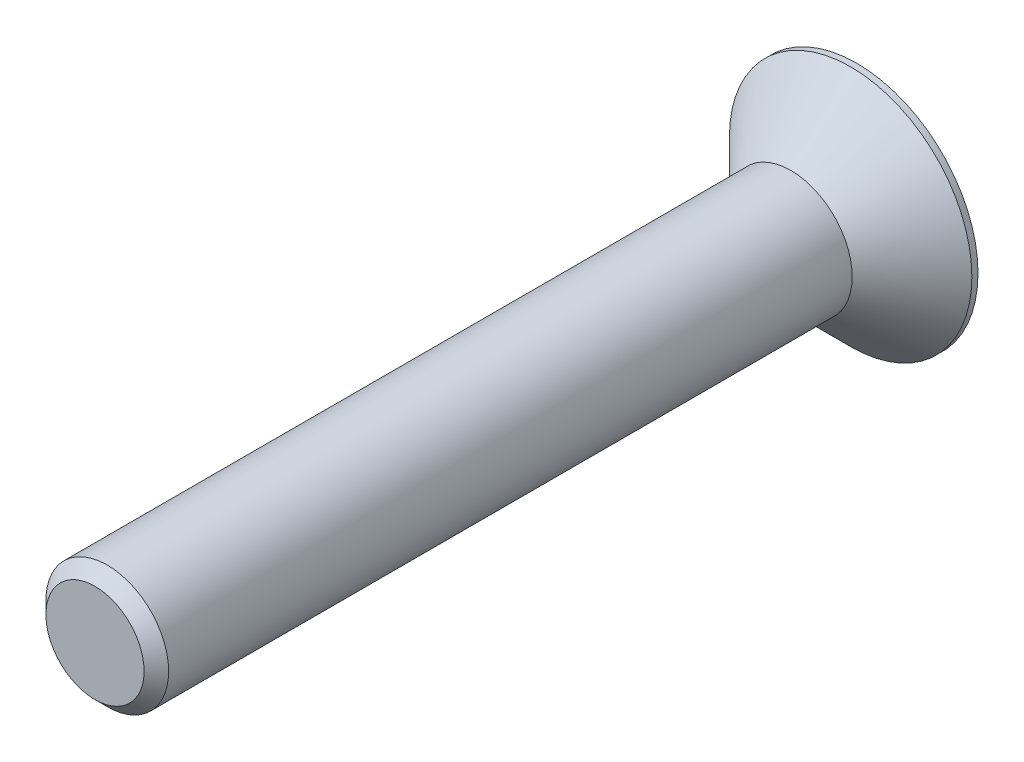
ISO-10303-21;
HEADER;
FILE_DESCRIPTION(('STEP AP214'),'2;1');
FILE_NAME('part.step','',(''),(''),'','','');
FILE_SCHEMA(('AUTOMOTIVE_DESIGN { 1 0 10303 214 1 1 1 1 }'));
ENDSEC;
DATA;
#1=APPLICATION_CONTEXT('core data for automotive mechanical design processes');
#2=APPLICATION_PROTOCOL_DEFINITION('international standard','automotive_design',2000,#1);
#3=PRODUCT_CONTEXT('',#1,'mechanical');
#4=PRODUCT('Part','Part','',(#3));
#5=PRODUCT_RELATED_PRODUCT_CATEGORY('part','',(#4));
#6=PRODUCT_DEFINITION_FORMATION('','',#4);
#7=PRODUCT_DEFINITION_CONTEXT('part definition',#1,'design');
#8=PRODUCT_DEFINITION('design','',#6,#7);
#9=PRODUCT_DEFINITION_SHAPE('','',#8);
#10=(LENGTH_UNIT() NAMED_UNIT(*) SI_UNIT(.MILLI.,.METRE.));
#11=(NAMED_UNIT(*) PLANE_ANGLE_UNIT() SI_UNIT($,.RADIAN.));
#12=(NAMED_UNIT(*) SI_UNIT($,.STERADIAN.) SOLID_ANGLE_UNIT());
#13=UNCERTAINTY_MEASURE_WITH_UNIT(LENGTH_MEASURE(1.E-05),#10,'distance_accuracy_value','');
#14=(GEOMETRIC_REPRESENTATION_CONTEXT(3) GLOBAL_UNCERTAINTY_ASSIGNED_CONTEXT((#13)) GLOBAL_UNIT_ASSIGNED_CONTEXT((#10,
#11,#12)) REPRESENTATION_CONTEXT('',''));
#15=CARTESIAN_POINT('',(0.,0.,0.));
#16=DIRECTION('',(0.,0.,1.));
#17=DIRECTION('',(1.,0.,0.));
#18=AXIS2_PLACEMENT_3D('',#15,#16,#17);
#19=CARTESIAN_POINT('',(7.9,0.,-4.29999999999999));
#20=DIRECTION('',(0.,0.,1.));
#21=DIRECTION('',(1.,0.,0.));
#22=AXIS2_PLACEMENT_3D('',#19,#20,#21);
#23=PLANE('',#22);
#24=CARTESIAN_POINT('',(0.,0.,-4.29999999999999));
#25=DIRECTION('',(0.,0.,-1.));
#26=DIRECTION('',(-1.,0.,0.));
#27=AXIS2_PLACEMENT_3D('',#24,#25,#26);
#28=CIRCLE('',#27,7.9);
#29=CARTESIAN_POINT('',(-7.9,0.,-4.29999999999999));
#30=VERTEX_POINT('',#29);
#31=EDGE_CURVE('E140',#30,#30,#28,.T.);
#32=ORIENTED_EDGE('',*,*,#31,.T.);
#33=EDGE_LOOP('',(#32));
#34=FACE_BOUND('',#33,.T.);
#35=DIRECTION('',(-0.86602540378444,0.499999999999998,0.));
#36=VECTOR('',#35,1.);
#37=CARTESIAN_POINT('',(0.,2.88675134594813,-4.29999999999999));
#38=LINE('',#37,#36);
#39=CARTESIAN_POINT('',(2.5,1.44337567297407,-4.29999999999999));
#40=VERTEX_POINT('',#39);
#41=CARTESIAN_POINT('',(0.,2.88675134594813,-4.29999999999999));
#42=VERTEX_POINT('',#41);
#43=EDGE_CURVE('E45',#40,#42,#38,.T.);
#44=ORIENTED_EDGE('',*,*,#43,.T.);
#45=DIRECTION('',(-0.866025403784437,-0.500000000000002,0.));
#46=VECTOR('',#45,1.);
#47=CARTESIAN_POINT('',(-2.5,1.44337567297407,-4.29999999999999));
#48=LINE('',#47,#46);
#49=CARTESIAN_POINT('',(-2.5,1.44337567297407,-4.29999999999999));
#50=VERTEX_POINT('',#49);
#51=EDGE_CURVE('E116',#42,#50,#48,.T.);
#52=ORIENTED_EDGE('',*,*,#51,.T.);
#53=DIRECTION('',(0.,-1.,0.));
#54=VECTOR('',#53,1.);
#55=CARTESIAN_POINT('',(-2.5,-1.44337567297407,-4.29999999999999));
#56=LINE('',#55,#54);
#57=CARTESIAN_POINT('',(-2.5,-1.44337567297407,-4.29999999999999));
#58=VERTEX_POINT('',#57);
#59=EDGE_CURVE('E120',#50,#58,#56,.T.);
#60=ORIENTED_EDGE('',*,*,#59,.T.);
#61=DIRECTION('',(0.866025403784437,-0.500000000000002,0.));
#62=VECTOR('',#61,1.);
#63=CARTESIAN_POINT('',(-2.5,-1.44337567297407,-4.29999999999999));
#64=LINE('',#63,#62);
#65=CARTESIAN_POINT('',(0.,-2.88675134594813,-4.29999999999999));
#66=VERTEX_POINT('',#65);
#67=EDGE_CURVE('E123',#58,#66,#64,.T.);
#68=ORIENTED_EDGE('',*,*,#67,.T.);
#69=DIRECTION('',(0.86602540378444,0.499999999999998,0.));
#70=VECTOR('',#69,1.);
#71=CARTESIAN_POINT('',(0.,-2.88675134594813,-4.29999999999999));
#72=LINE('',#71,#70);
#73=CARTESIAN_POINT('',(2.5,-1.44337567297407,-4.29999999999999));
#74=VERTEX_POINT('',#73);
#75=EDGE_CURVE('E106',#66,#74,#72,.T.);
#76=ORIENTED_EDGE('',*,*,#75,.T.);
#77=DIRECTION('',(0.,1.,0.));
#78=VECTOR('',#77,1.);
#79=CARTESIAN_POINT('',(2.5,-1.44337567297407,-4.29999999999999));
#80=LINE('',#79,#78);
#81=EDGE_CURVE('E126',#74,#40,#80,.T.);
#82=ORIENTED_EDGE('',*,*,#81,.T.);
#83=EDGE_LOOP('',(#44,#52,#60,#68,#76,#82));
#84=FACE_BOUND('',#83,.T.);
#85=ADVANCED_FACE('F30',(#34,#84),#23,.F.);
#86=CARTESIAN_POINT('',(0.,0.,0.));
#87=DIRECTION('',(0.,0.,-1.));
#88=DIRECTION('',(-1.,0.,0.));
#89=AXIS2_PLACEMENT_3D('',#86,#87,#88);
#90=CYLINDRICAL_SURFACE('',#89,7.9);
#91=ORIENTED_EDGE('',*,*,#31,.F.);
#92=EDGE_LOOP('',(#91));
#93=FACE_BOUND('',#92,.T.);
#94=CARTESIAN_POINT('',(0.,0.,-3.89999999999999));
#95=DIRECTION('',(0.,0.,-1.));
#96=DIRECTION('',(-1.,0.,0.));
#97=AXIS2_PLACEMENT_3D('',#94,#95,#96);
#98=CIRCLE('',#97,7.9);
#99=CARTESIAN_POINT('',(-7.9,0.,-3.89999999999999));
#100=VERTEX_POINT('',#99);
#101=EDGE_CURVE('E137',#100,#100,#98,.T.);
#102=ORIENTED_EDGE('',*,*,#101,.T.);
#103=EDGE_LOOP('',(#102));
#104=FACE_BOUND('',#103,.T.);
#105=ADVANCED_FACE('F157',(#93,#104),#90,.T.);
#106=CARTESIAN_POINT('',(0.,0.,0.));
#107=DIRECTION('',(0.,0.,-1.));
#108=DIRECTION('',(-1.,0.,0.));
#109=AXIS2_PLACEMENT_3D('',#106,#107,#108);
#110=CONICAL_SURFACE('',#109,4.,0.78539816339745);
#111=ORIENTED_EDGE('',*,*,#101,.F.);
#112=EDGE_LOOP('',(#111));
#113=FACE_BOUND('',#112,.T.);
#114=CARTESIAN_POINT('',(0.,0.,0.));
#115=DIRECTION('',(0.,0.,1.));
#116=DIRECTION('',(1.,0.,0.));
#117=AXIS2_PLACEMENT_3D('',#114,#115,#116);
#118=CIRCLE('',#117,4.);
#119=CARTESIAN_POINT('',(4.,0.,0.));
#120=VERTEX_POINT('',#119);
#121=EDGE_CURVE('E117',#120,#120,#118,.T.);
#122=ORIENTED_EDGE('',*,*,#121,.F.);
#123=EDGE_LOOP('',(#122));
#124=FACE_BOUND('',#123,.T.);
#125=ADVANCED_FACE('F162',(#113,#124),#110,.T.);
#126=CARTESIAN_POINT('',(0.,2.88675134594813,-0.499999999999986));
#127=DIRECTION('',(-0.499999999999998,-0.86602540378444,0.));
#128=DIRECTION('',(0.86602540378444,-0.499999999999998,0.));
#129=AXIS2_PLACEMENT_3D('',#126,#127,#128);
#130=PLANE('',#129);
#131=ORIENTED_EDGE('',*,*,#43,.F.);
#132=DIRECTION('',(0.,0.,-1.));
#133=VECTOR('',#132,1.);
#134=CARTESIAN_POINT('',(2.5,1.44337567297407,-0.499999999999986));
#135=LINE('',#134,#133);
#136=CARTESIAN_POINT('',(2.5,1.44337567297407,-0.499999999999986));
#137=VERTEX_POINT('',#136);
#138=EDGE_CURVE('E111',#137,#40,#135,.T.);
#139=ORIENTED_EDGE('',*,*,#138,.F.);
#140=DIRECTION('',(-0.86602540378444,0.499999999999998,0.));
#141=VECTOR('',#140,1.);
#142=CARTESIAN_POINT('',(0.,2.88675134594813,-0.499999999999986));
#143=LINE('',#142,#141);
#144=CARTESIAN_POINT('',(0.,2.88675134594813,-0.499999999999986));
#145=VERTEX_POINT('',#144);
#146=EDGE_CURVE('E129',#137,#145,#143,.T.);
#147=ORIENTED_EDGE('',*,*,#146,.T.);
#148=DIRECTION('',(0.,0.,-1.));
#149=VECTOR('',#148,1.);
#150=CARTESIAN_POINT('',(0.,2.88675134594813,-0.499999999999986));
#151=LINE('',#150,#149);
#152=EDGE_CURVE('E135',#145,#42,#151,.T.);
#153=ORIENTED_EDGE('',*,*,#152,.T.);
#154=EDGE_LOOP('',(#131,#139,#147,#153));
#155=FACE_BOUND('',#154,.T.);
#156=ADVANCED_FACE('F169',(#155),#130,.T.);
#157=CARTESIAN_POINT('',(-2.5,1.44337567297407,-0.499999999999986));
#158=DIRECTION('',(0.500000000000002,-0.866025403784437,0.));
#159=DIRECTION('',(0.866025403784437,0.500000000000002,0.));
#160=AXIS2_PLACEMENT_3D('',#157,#158,#159);
#161=PLANE('',#160);
#162=ORIENTED_EDGE('',*,*,#51,.F.);
#163=ORIENTED_EDGE('',*,*,#152,.F.);
#164=DIRECTION('',(-0.866025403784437,-0.500000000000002,0.));
#165=VECTOR('',#164,1.);
#166=CARTESIAN_POINT('',(-2.5,1.44337567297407,-0.499999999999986));
#167=LINE('',#166,#165);
#168=CARTESIAN_POINT('',(-2.5,1.44337567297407,-0.499999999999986));
#169=VERTEX_POINT('',#168);
#170=EDGE_CURVE('E84',#145,#169,#167,.T.);
#171=ORIENTED_EDGE('',*,*,#170,.T.);
#172=DIRECTION('',(0.,0.,-1.));
#173=VECTOR('',#172,1.);
#174=CARTESIAN_POINT('',(-2.5,1.44337567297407,-0.499999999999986));
#175=LINE('',#174,#173);
#176=EDGE_CURVE('E133',#169,#50,#175,.T.);
#177=ORIENTED_EDGE('',*,*,#176,.T.);
#178=EDGE_LOOP('',(#162,#163,#171,#177));
#179=FACE_BOUND('',#178,.T.);
#180=ADVANCED_FACE('F173',(#179),#161,.T.);
#181=CARTESIAN_POINT('',(-2.5,-1.44337567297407,-0.499999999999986));
#182=DIRECTION('',(1.,0.,0.));
#183=DIRECTION('',(0.,0.,-1.));
#184=AXIS2_PLACEMENT_3D('',#181,#182,#183);
#185=PLANE('',#184);
#186=ORIENTED_EDGE('',*,*,#59,.F.);
#187=ORIENTED_EDGE('',*,*,#176,.F.);
#188=DIRECTION('',(0.,-1.,0.));
#189=VECTOR('',#188,1.);
#190=CARTESIAN_POINT('',(-2.5,-1.44337567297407,-0.499999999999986));
#191=LINE('',#190,#189);
#192=CARTESIAN_POINT('',(-2.5,-1.44337567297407,-0.499999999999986));
#193=VERTEX_POINT('',#192);
#194=EDGE_CURVE('E102',#169,#193,#191,.T.);
#195=ORIENTED_EDGE('',*,*,#194,.T.);
#196=DIRECTION('',(0.,0.,-1.));
#197=VECTOR('',#196,1.);
#198=CARTESIAN_POINT('',(-2.5,-1.44337567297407,-0.499999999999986));
#199=LINE('',#198,#197);
#200=EDGE_CURVE('E99',#193,#58,#199,.T.);
#201=ORIENTED_EDGE('',*,*,#200,.T.);
#202=EDGE_LOOP('',(#186,#187,#195,#201));
#203=FACE_BOUND('',#202,.T.);
#204=ADVANCED_FACE('F176',(#203),#185,.T.);
#205=CARTESIAN_POINT('',(-2.5,-1.44337567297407,-0.499999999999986));
#206=DIRECTION('',(0.500000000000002,0.866025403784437,0.));
#207=DIRECTION('',(-0.866025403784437,0.500000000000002,0.));
#208=AXIS2_PLACEMENT_3D('',#205,#206,#207);
#209=PLANE('',#208);
#210=ORIENTED_EDGE('',*,*,#67,.F.);
#211=ORIENTED_EDGE('',*,*,#200,.F.);
#212=DIRECTION('',(0.866025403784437,-0.500000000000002,0.));
#213=VECTOR('',#212,1.);
#214=CARTESIAN_POINT('',(-2.5,-1.44337567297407,-0.499999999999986));
#215=LINE('',#214,#213);
#216=CARTESIAN_POINT('',(0.,-2.88675134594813,-0.499999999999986));
#217=VERTEX_POINT('',#216);
#218=EDGE_CURVE('E94',#193,#217,#215,.T.);
#219=ORIENTED_EDGE('',*,*,#218,.T.);
#220=DIRECTION('',(0.,0.,-1.));
#221=VECTOR('',#220,1.);
#222=CARTESIAN_POINT('',(0.,-2.88675134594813,-0.499999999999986));
#223=LINE('',#222,#221);
#224=EDGE_CURVE('E98',#217,#66,#223,.T.);
#225=ORIENTED_EDGE('',*,*,#224,.T.);
#226=EDGE_LOOP('',(#210,#211,#219,#225));
#227=FACE_BOUND('',#226,.T.);
#228=ADVANCED_FACE('F97',(#227),#209,.T.);
#229=CARTESIAN_POINT('',(0.,-2.88675134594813,-0.499999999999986));
#230=DIRECTION('',(-0.499999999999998,0.86602540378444,0.));
#231=DIRECTION('',(-0.86602540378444,-0.499999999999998,0.));
#232=AXIS2_PLACEMENT_3D('',#229,#230,#231);
#233=PLANE('',#232);
#234=ORIENTED_EDGE('',*,*,#75,.F.);
#235=ORIENTED_EDGE('',*,*,#224,.F.);
#236=DIRECTION('',(0.86602540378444,0.499999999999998,0.));
#237=VECTOR('',#236,1.);
#238=CARTESIAN_POINT('',(0.,-2.88675134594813,-0.499999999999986));
#239=LINE('',#238,#237);
#240=CARTESIAN_POINT('',(2.5,-1.44337567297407,-0.499999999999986));
#241=VERTEX_POINT('',#240);
#242=EDGE_CURVE('E101',#217,#241,#239,.T.);
#243=ORIENTED_EDGE('',*,*,#242,.T.);
#244=DIRECTION('',(0.,0.,-1.));
#245=VECTOR('',#244,1.);
#246=CARTESIAN_POINT('',(2.5,-1.44337567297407,-0.499999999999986));
#247=LINE('',#246,#245);
#248=EDGE_CURVE('E75',#241,#74,#247,.T.);
#249=ORIENTED_EDGE('',*,*,#248,.T.);
#250=EDGE_LOOP('',(#234,#235,#243,#249));
#251=FACE_BOUND('',#250,.T.);
#252=ADVANCED_FACE('F104',(#251),#233,.T.);
#253=CARTESIAN_POINT('',(2.5,-1.44337567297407,-0.499999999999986));
#254=DIRECTION('',(-1.,0.,0.));
#255=DIRECTION('',(0.,0.,1.));
#256=AXIS2_PLACEMENT_3D('',#253,#254,#255);
#257=PLANE('',#256);
#258=ORIENTED_EDGE('',*,*,#81,.F.);
#259=ORIENTED_EDGE('',*,*,#248,.F.);
#260=DIRECTION('',(0.,1.,0.));
#261=VECTOR('',#260,1.);
#262=CARTESIAN_POINT('',(2.5,-1.44337567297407,-0.499999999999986));
#263=LINE('',#262,#261);
#264=EDGE_CURVE('E53',#241,#137,#263,.T.);
#265=ORIENTED_EDGE('',*,*,#264,.T.);
#266=ORIENTED_EDGE('',*,*,#138,.T.);
#267=EDGE_LOOP('',(#258,#259,#265,#266));
#268=FACE_BOUND('',#267,.T.);
#269=ADVANCED_FACE('F185',(#268),#257,.T.);
#270=CARTESIAN_POINT('',(2.5,1.44337567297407,-0.499999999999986));
#271=DIRECTION('',(0.,0.,1.));
#272=DIRECTION('',(1.,0.,0.));
#273=AXIS2_PLACEMENT_3D('',#270,#271,#272);
#274=PLANE('',#273);
#275=ORIENTED_EDGE('',*,*,#146,.F.);
#276=ORIENTED_EDGE('',*,*,#264,.F.);
#277=ORIENTED_EDGE('',*,*,#242,.F.);
#278=ORIENTED_EDGE('',*,*,#218,.F.);
#279=ORIENTED_EDGE('',*,*,#194,.F.);
#280=ORIENTED_EDGE('',*,*,#170,.F.);
#281=EDGE_LOOP('',(#275,#276,#277,#278,#279,#280));
#282=FACE_BOUND('',#281,.T.);
#283=ADVANCED_FACE('F109',(#282),#274,.F.);
#284=CARTESIAN_POINT('',(0.,0.,45.35));
#285=DIRECTION('',(0.,0.,1.));
#286=DIRECTION('',(1.,0.,0.));
#287=AXIS2_PLACEMENT_3D('',#284,#285,#286);
#288=PLANE('',#287);
#289=CARTESIAN_POINT('',(0.,0.,45.35));
#290=DIRECTION('',(0.,0.,1.));
#291=DIRECTION('',(1.,0.,0.));
#292=AXIS2_PLACEMENT_3D('',#289,#290,#291);
#293=CIRCLE('',#292,3.2);
#294=CARTESIAN_POINT('',(3.20000000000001,0.,45.35));
#295=VERTEX_POINT('',#294);
#296=EDGE_CURVE('E38',#295,#295,#293,.T.);
#297=ORIENTED_EDGE('',*,*,#296,.T.);
#298=EDGE_LOOP('',(#297));
#299=FACE_BOUND('',#298,.T.);
#300=ADVANCED_FACE('F145',(#299),#288,.T.);
#301=CARTESIAN_POINT('',(0.,0.,0.));
#302=DIRECTION('',(0.,0.,1.));
#303=DIRECTION('',(1.,0.,0.));
#304=AXIS2_PLACEMENT_3D('',#301,#302,#303);
#305=CYLINDRICAL_SURFACE('',#304,4.);
#306=CARTESIAN_POINT('',(0.,0.,44.55));
#307=DIRECTION('',(0.,0.,1.));
#308=DIRECTION('',(1.,0.,0.));
#309=AXIS2_PLACEMENT_3D('',#306,#307,#308);
#310=CIRCLE('',#309,4.);
#311=CARTESIAN_POINT('',(4.00000000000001,0.,44.55));
#312=VERTEX_POINT('',#311);
#313=EDGE_CURVE('E11',#312,#312,#310,.F.);
#314=ORIENTED_EDGE('',*,*,#313,.T.);
#315=EDGE_LOOP('',(#314));
#316=FACE_BOUND('',#315,.T.);
#317=ORIENTED_EDGE('',*,*,#121,.T.);
#318=EDGE_LOOP('',(#317));
#319=FACE_BOUND('',#318,.T.);
#320=ADVANCED_FACE('F148',(#316,#319),#305,.T.);
#321=CARTESIAN_POINT('',(0.,0.,45.35));
#322=DIRECTION('',(0.,0.,-1.));
#323=DIRECTION('',(-1.,0.,0.));
#324=AXIS2_PLACEMENT_3D('',#321,#322,#323);
#325=CONICAL_SURFACE('',#324,3.2,0.78539816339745);
#326=ORIENTED_EDGE('',*,*,#313,.F.);
#327=EDGE_LOOP('',(#326));
#328=FACE_BOUND('',#327,.T.);
#329=ORIENTED_EDGE('',*,*,#296,.F.);
#330=EDGE_LOOP('',(#329));
#331=FACE_BOUND('',#330,.T.);
#332=ADVANCED_FACE('F32',(#328,#331),#325,.T.);
#333=CLOSED_SHELL('',(#85,#105,#125,#156,#180,#204,#228,#252,#269,#283,#300,#320,#332));
#334=MANIFOLD_SOLID_BREP('B2',#333);
#335=ADVANCED_BREP_SHAPE_REPRESENTATION('',(#18,#334),#14);
#336=SHAPE_DEFINITION_REPRESENTATION(#9,#335);
ENDSEC;
END-ISO-10303-21;
